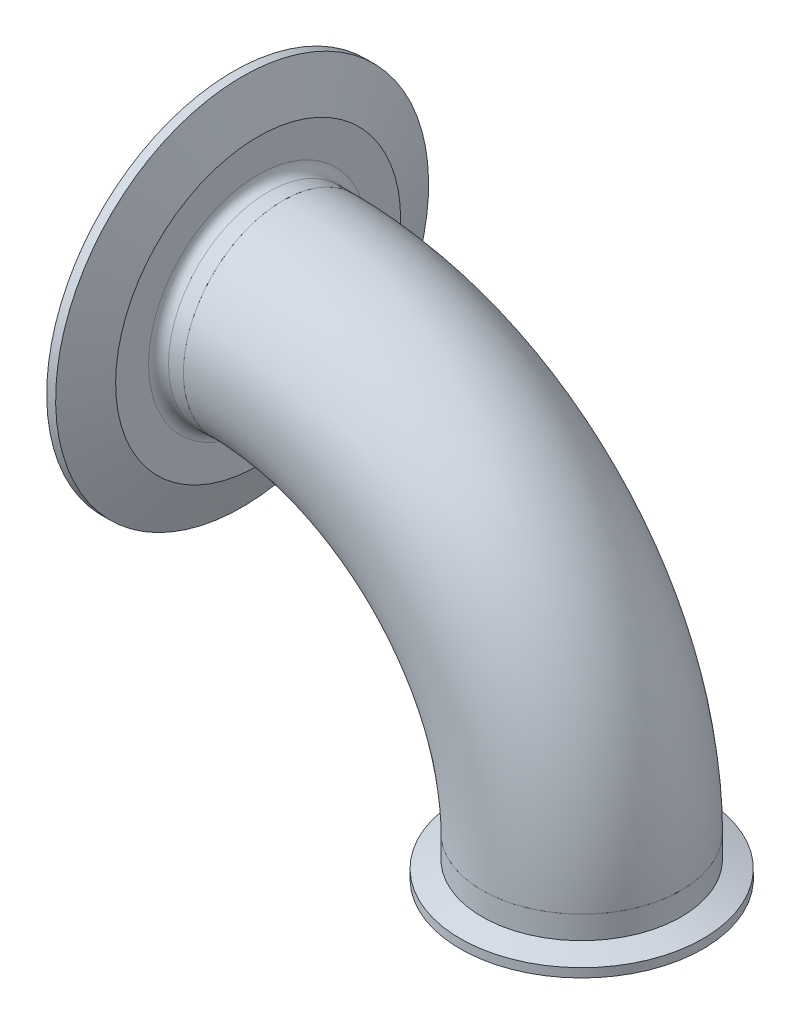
ISO-10303-21;
HEADER;
FILE_DESCRIPTION(('STEP AP214'),'2;1');
FILE_NAME('part.step','',(''),(''),'','','');
FILE_SCHEMA(('AUTOMOTIVE_DESIGN { 1 0 10303 214 1 1 1 1 }'));
ENDSEC;
DATA;
#1=APPLICATION_CONTEXT('core data for automotive mechanical design processes');
#2=APPLICATION_PROTOCOL_DEFINITION('international standard','automotive_design',2000,#1);
#3=PRODUCT_CONTEXT('',#1,'mechanical');
#4=PRODUCT('Part','Part','',(#3));
#5=PRODUCT_RELATED_PRODUCT_CATEGORY('part','',(#4));
#6=PRODUCT_DEFINITION_FORMATION('','',#4);
#7=PRODUCT_DEFINITION_CONTEXT('part definition',#1,'design');
#8=PRODUCT_DEFINITION('design','',#6,#7);
#9=PRODUCT_DEFINITION_SHAPE('','',#8);
#10=(LENGTH_UNIT() NAMED_UNIT(*) SI_UNIT(.MILLI.,.METRE.));
#11=(NAMED_UNIT(*) PLANE_ANGLE_UNIT() SI_UNIT($,.RADIAN.));
#12=(NAMED_UNIT(*) SI_UNIT($,.STERADIAN.) SOLID_ANGLE_UNIT());
#13=UNCERTAINTY_MEASURE_WITH_UNIT(LENGTH_MEASURE(1.E-05),#10,'distance_accuracy_value','');
#14=(GEOMETRIC_REPRESENTATION_CONTEXT(3) GLOBAL_UNCERTAINTY_ASSIGNED_CONTEXT((#13)) GLOBAL_UNIT_ASSIGNED_CONTEXT((#10,
#11,#12)) REPRESENTATION_CONTEXT('',''));
#15=CARTESIAN_POINT('',(0.,0.,0.));
#16=DIRECTION('',(0.,0.,1.));
#17=DIRECTION('',(1.,0.,0.));
#18=AXIS2_PLACEMENT_3D('',#15,#16,#17);
#19=CARTESIAN_POINT('',(-0.267699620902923,45.4213983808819,136.807967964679));
#20=DIRECTION('',(0.,0.,-1.));
#21=DIRECTION('',(-1.,0.,0.));
#22=AXIS2_PLACEMENT_3D('',#19,#20,#21);
#23=TOROIDAL_SURFACE('',#22,95.25,31.75);
#24=CARTESIAN_POINT('',(-0.267699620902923,140.671398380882,136.807967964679));
#25=DIRECTION('',(-1.,0.,0.));
#26=DIRECTION('',(0.,0.,1.));
#27=AXIS2_PLACEMENT_3D('',#24,#25,#26);
#28=CIRCLE('',#27,31.75);
#29=CARTESIAN_POINT('',(-0.267699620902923,172.421398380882,136.807967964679));
#30=VERTEX_POINT('',#29);
#31=EDGE_CURVE('P0_E10',#30,#30,#28,.T.);
#32=CARTESIAN_POINT('',(94.9823003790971,45.4213983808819,136.807967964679));
#33=DIRECTION('',(0.,1.,0.));
#34=DIRECTION('',(0.,0.,1.));
#35=AXIS2_PLACEMENT_3D('',#32,#33,#34);
#36=CIRCLE('',#35,31.75);
#37=CARTESIAN_POINT('',(126.732300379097,45.4213983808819,136.807967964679));
#38=VERTEX_POINT('',#37);
#39=EDGE_CURVE('P0_E21',#38,#38,#36,.T.);
#40=CARTESIAN_POINT('',(-0.267699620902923,45.4213983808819,136.807967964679));
#41=DIRECTION('',(0.,0.,-1.));
#42=DIRECTION('',(-1.,0.,0.));
#43=AXIS2_PLACEMENT_3D('',#40,#41,#42);
#44=CIRCLE('',#43,127.);
#45=EDGE_CURVE('',#30,#38,#44,.T.);
#46=ORIENTED_EDGE('',*,*,#31,.F.);
#47=ORIENTED_EDGE('',*,*,#39,.T.);
#48=ORIENTED_EDGE('',*,*,#45,.T.);
#49=ORIENTED_EDGE('',*,*,#45,.F.);
#50=EDGE_LOOP('',(#46,#48,#47,#49));
#51=FACE_BOUND('',#50,.T.);
#52=ADVANCED_FACE('P0_F15',(#51),#23,.T.);
#53=CARTESIAN_POINT('',(-0.267699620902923,140.671398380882,136.807967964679));
#54=DIRECTION('',(-1.,0.,0.));
#55=DIRECTION('',(0.,0.,1.));
#56=AXIS2_PLACEMENT_3D('',#53,#54,#55);
#57=PLANE('',#56);
#58=CARTESIAN_POINT('',(-0.267699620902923,140.671398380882,136.807967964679));
#59=DIRECTION('',(-1.,0.,0.));
#60=DIRECTION('',(0.,-1.,0.));
#61=AXIS2_PLACEMENT_3D('',#58,#59,#60);
#62=CIRCLE('',#61,30.099);
#63=CARTESIAN_POINT('',(-0.267699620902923,170.770398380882,136.807967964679));
#64=VERTEX_POINT('',#63);
#65=EDGE_CURVE('P0_E25',#64,#64,#62,.T.);
#66=ORIENTED_EDGE('',*,*,#65,.F.);
#67=EDGE_LOOP('',(#66));
#68=FACE_BOUND('',#67,.T.);
#69=ORIENTED_EDGE('',*,*,#31,.T.);
#70=EDGE_LOOP('',(#69));
#71=FACE_BOUND('',#70,.T.);
#72=ADVANCED_FACE('P0_F46',(#68,#71),#57,.T.);
#73=CARTESIAN_POINT('',(94.9823003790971,45.4213983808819,136.807967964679));
#74=DIRECTION('',(0.,1.,0.));
#75=DIRECTION('',(0.,0.,1.));
#76=AXIS2_PLACEMENT_3D('',#73,#74,#75);
#77=PLANE('',#76);
#78=CARTESIAN_POINT('',(94.9823003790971,45.4213983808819,136.807967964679));
#79=DIRECTION('',(0.,1.,0.));
#80=DIRECTION('',(0.,0.,1.));
#81=AXIS2_PLACEMENT_3D('',#78,#79,#80);
#82=CIRCLE('',#81,30.099);
#83=CARTESIAN_POINT('',(125.081300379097,45.4213983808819,136.807967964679));
#84=VERTEX_POINT('',#83);
#85=EDGE_CURVE('P0_E29',#84,#84,#82,.T.);
#86=ORIENTED_EDGE('',*,*,#85,.T.);
#87=EDGE_LOOP('',(#86));
#88=FACE_BOUND('',#87,.T.);
#89=ORIENTED_EDGE('',*,*,#39,.F.);
#90=EDGE_LOOP('',(#89));
#91=FACE_BOUND('',#90,.T.);
#92=ADVANCED_FACE('P0_F35',(#88,#91),#77,.F.);
#93=CARTESIAN_POINT('',(-0.267699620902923,45.4213983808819,136.807967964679));
#94=DIRECTION('',(0.,0.,-1.));
#95=DIRECTION('',(-1.,0.,0.));
#96=AXIS2_PLACEMENT_3D('',#93,#94,#95);
#97=TOROIDAL_SURFACE('',#96,95.25,30.099);
#98=CARTESIAN_POINT('',(-0.267699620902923,45.4213983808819,136.807967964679));
#99=DIRECTION('',(0.,0.,-1.));
#100=DIRECTION('',(-1.,0.,0.));
#101=AXIS2_PLACEMENT_3D('',#98,#99,#100);
#102=CIRCLE('',#101,125.349);
#103=EDGE_CURVE('',#64,#84,#102,.T.);
#104=ORIENTED_EDGE('',*,*,#65,.T.);
#105=ORIENTED_EDGE('',*,*,#85,.F.);
#106=ORIENTED_EDGE('',*,*,#103,.T.);
#107=ORIENTED_EDGE('',*,*,#103,.F.);
#108=EDGE_LOOP('',(#104,#106,#105,#107));
#109=FACE_BOUND('',#108,.T.);
#110=ADVANCED_FACE('P0_F38',(#109),#97,.F.);
#111=CLOSED_SHELL('',(#52,#72,#92,#110));
#112=MANIFOLD_SOLID_BREP('P0_B1',#111);
#113=CARTESIAN_POINT('',(-0.267699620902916,160.541922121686,159.415756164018));
#114=DIRECTION('',(-1.,0.,0.));
#115=DIRECTION('',(0.,0.751114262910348,-0.660172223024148));
#116=AXIS2_PLACEMENT_3D('',#113,#114,#115);
#117=PLANE('',#116);
#118=CARTESIAN_POINT('',(-0.267699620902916,140.671398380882,136.807967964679));
#119=DIRECTION('',(-1.,0.,0.));
#120=DIRECTION('',(0.,0.751114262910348,-0.660172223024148));
#121=AXIS2_PLACEMENT_3D('',#118,#119,#120);
#122=CIRCLE('',#121,31.75);
#123=CARTESIAN_POINT('',(-0.267699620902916,164.519276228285,115.847499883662));
#124=VERTEX_POINT('',#123);
#125=EDGE_CURVE('P1_E9',#124,#124,#122,.T.);
#126=ORIENTED_EDGE('',*,*,#125,.F.);
#127=EDGE_LOOP('',(#126));
#128=FACE_BOUND('',#127,.T.);
#129=CARTESIAN_POINT('',(-0.267699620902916,140.671398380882,136.807967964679));
#130=DIRECTION('',(-1.,0.,0.));
#131=DIRECTION('',(0.,0.751114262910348,-0.660172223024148));
#132=AXIS2_PLACEMENT_3D('',#129,#130,#131);
#133=CIRCLE('',#132,30.099);
#134=CARTESIAN_POINT('',(-0.267699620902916,163.27918658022,116.937444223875));
#135=VERTEX_POINT('',#134);
#136=EDGE_CURVE('P1_E63',#135,#135,#133,.T.);
#137=ORIENTED_EDGE('',*,*,#136,.T.);
#138=EDGE_LOOP('',(#137));
#139=FACE_BOUND('',#138,.T.);
#140=ADVANCED_FACE('P1_F14',(#128,#139),#117,.F.);
#141=CARTESIAN_POINT('',(-16.1426996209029,140.671398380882,136.807967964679));
#142=DIRECTION('',(-1.,0.,0.));
#143=DIRECTION('',(0.,0.751114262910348,-0.660172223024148));
#144=AXIS2_PLACEMENT_3D('',#141,#142,#143);
#145=CYLINDRICAL_SURFACE('',#144,31.75);
#146=CARTESIAN_POINT('',(-5.01749962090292,140.671398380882,136.807967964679));
#147=DIRECTION('',(-1.,0.,0.));
#148=DIRECTION('',(0.,0.751114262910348,-0.660172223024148));
#149=AXIS2_PLACEMENT_3D('',#146,#147,#148);
#150=CIRCLE('',#149,31.75);
#151=CARTESIAN_POINT('',(-5.01749962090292,164.519276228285,115.847499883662));
#152=VERTEX_POINT('',#151);
#153=EDGE_CURVE('P1_E20',#152,#152,#150,.T.);
#154=ORIENTED_EDGE('',*,*,#153,.F.);
#155=EDGE_LOOP('',(#154));
#156=FACE_BOUND('',#155,.T.);
#157=ORIENTED_EDGE('',*,*,#125,.T.);
#158=EDGE_LOOP('',(#157));
#159=FACE_BOUND('',#158,.T.);
#160=ADVANCED_FACE('P1_F142',(#156,#159),#145,.T.);
#161=CARTESIAN_POINT('',(-5.01749962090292,140.671398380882,136.807967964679));
#162=DIRECTION('',(-1.,0.,0.));
#163=DIRECTION('',(0.,0.751114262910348,-0.660172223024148));
#164=AXIS2_PLACEMENT_3D('',#161,#162,#163);
#165=TOROIDAL_SURFACE('',#164,34.925,3.175);
#166=CARTESIAN_POINT('',(-8.19249962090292,140.671398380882,136.807967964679));
#167=DIRECTION('',(-1.,0.,0.));
#168=DIRECTION('',(0.,0.751114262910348,-0.660172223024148));
#169=AXIS2_PLACEMENT_3D('',#166,#167,#168);
#170=CIRCLE('',#169,34.925);
#171=CARTESIAN_POINT('',(-8.19249962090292,166.904064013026,113.751453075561));
#172=VERTEX_POINT('',#171);
#173=EDGE_CURVE('P1_E24',#172,#172,#170,.T.);
#174=ORIENTED_EDGE('',*,*,#173,.F.);
#175=EDGE_LOOP('',(#174));
#176=FACE_BOUND('',#175,.T.);
#177=ORIENTED_EDGE('',*,*,#153,.T.);
#178=EDGE_LOOP('',(#177));
#179=FACE_BOUND('',#178,.T.);
#180=ADVANCED_FACE('P1_F137',(#176,#179),#165,.F.);
#181=CARTESIAN_POINT('',(-8.19249962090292,163.72791327,163.040633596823));
#182=DIRECTION('',(-1.,0.,0.));
#183=DIRECTION('',(0.,0.751114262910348,-0.660172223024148));
#184=AXIS2_PLACEMENT_3D('',#181,#182,#183);
#185=PLANE('',#184);
#186=CARTESIAN_POINT('',(-8.19249962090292,140.671398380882,136.807967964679));
#187=DIRECTION('',(-1.,0.,0.));
#188=DIRECTION('',(0.,0.751114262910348,-0.660172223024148));
#189=AXIS2_PLACEMENT_3D('',#186,#187,#188);
#190=CIRCLE('',#189,45.4344287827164);
#191=CARTESIAN_POINT('',(-8.19249962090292,174.797845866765,106.813420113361));
#192=VERTEX_POINT('',#191);
#193=EDGE_CURVE('P1_E28',#192,#192,#190,.T.);
#194=ORIENTED_EDGE('',*,*,#193,.F.);
#195=EDGE_LOOP('',(#194));
#196=FACE_BOUND('',#195,.T.);
#197=ORIENTED_EDGE('',*,*,#173,.T.);
#198=EDGE_LOOP('',(#197));
#199=FACE_BOUND('',#198,.T.);
#200=ADVANCED_FACE('P1_F131',(#196,#199),#185,.F.);
#201=CARTESIAN_POINT('',(-8.19249962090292,140.671398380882,136.807967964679));
#202=DIRECTION('',(-1.,0.,0.));
#203=DIRECTION('',(0.,0.751114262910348,-0.660172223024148));
#204=AXIS2_PLACEMENT_3D('',#201,#202,#203);
#205=CONICAL_SURFACE('',#204,45.4344287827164,1.22173047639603);
#206=CARTESIAN_POINT('',(-13.2978996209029,140.671398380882,136.807967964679));
#207=DIRECTION('',(-1.,0.,0.));
#208=DIRECTION('',(0.,0.751114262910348,-0.660172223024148));
#209=AXIS2_PLACEMENT_3D('',#206,#207,#208);
#210=CIRCLE('',#209,59.4614);
#211=CARTESIAN_POINT('',(-13.2978996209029,185.333704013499,97.5532033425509));
#212=VERTEX_POINT('',#211);
#213=EDGE_CURVE('P1_E33',#212,#212,#210,.T.);
#214=ORIENTED_EDGE('',*,*,#213,.F.);
#215=EDGE_LOOP('',(#214));
#216=FACE_BOUND('',#215,.T.);
#217=ORIENTED_EDGE('',*,*,#193,.T.);
#218=EDGE_LOOP('',(#217));
#219=FACE_BOUND('',#218,.T.);
#220=ADVANCED_FACE('P1_F125',(#216,#219),#205,.T.);
#221=CARTESIAN_POINT('',(-16.1426996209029,140.671398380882,136.807967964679));
#222=DIRECTION('',(-1.,0.,0.));
#223=DIRECTION('',(0.,0.751114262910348,-0.660172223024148));
#224=AXIS2_PLACEMENT_3D('',#221,#222,#223);
#225=CYLINDRICAL_SURFACE('',#224,59.4614);
#226=CARTESIAN_POINT('',(-16.1426996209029,140.671398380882,136.807967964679));
#227=DIRECTION('',(-1.,0.,0.));
#228=DIRECTION('',(0.,0.751114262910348,-0.660172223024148));
#229=AXIS2_PLACEMENT_3D('',#226,#227,#228);
#230=CIRCLE('',#229,59.4614);
#231=CARTESIAN_POINT('',(-16.1426996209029,185.333704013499,97.5532033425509));
#232=VERTEX_POINT('',#231);
#233=EDGE_CURVE('P1_E36',#232,#232,#230,.T.);
#234=ORIENTED_EDGE('',*,*,#233,.F.);
#235=EDGE_LOOP('',(#234));
#236=FACE_BOUND('',#235,.T.);
#237=ORIENTED_EDGE('',*,*,#213,.T.);
#238=EDGE_LOOP('',(#237));
#239=FACE_BOUND('',#238,.T.);
#240=ADVANCED_FACE('P1_F119',(#236,#239),#225,.T.);
#241=CARTESIAN_POINT('',(-16.1426996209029,179.92616300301,181.470273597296));
#242=DIRECTION('',(1.,0.,0.));
#243=DIRECTION('',(0.,-0.751114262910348,0.660172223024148));
#244=AXIS2_PLACEMENT_3D('',#241,#242,#243);
#245=PLANE('',#244);
#246=CARTESIAN_POINT('',(-16.1426996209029,140.671398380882,136.807967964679));
#247=DIRECTION('',(-1.,0.,0.));
#248=DIRECTION('',(0.,0.751114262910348,-0.660172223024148));
#249=AXIS2_PLACEMENT_3D('',#246,#247,#248);
#250=CIRCLE('',#249,56.924857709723);
#251=CARTESIAN_POINT('',(-16.1426996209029,183.428470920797,99.2277581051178));
#252=VERTEX_POINT('',#251);
#253=EDGE_CURVE('P1_E39',#252,#252,#250,.T.);
#254=ORIENTED_EDGE('',*,*,#253,.F.);
#255=EDGE_LOOP('',(#254));
#256=FACE_BOUND('',#255,.T.);
#257=ORIENTED_EDGE('',*,*,#233,.T.);
#258=EDGE_LOOP('',(#257));
#259=FACE_BOUND('',#258,.T.);
#260=ADVANCED_FACE('P1_F113',(#256,#259),#245,.F.);
#261=CARTESIAN_POINT('',(-15.365980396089,140.671398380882,136.807967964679));
#262=DIRECTION('',(-1.,0.,0.));
#263=DIRECTION('',(0.,0.751114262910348,-0.660172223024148));
#264=AXIS2_PLACEMENT_3D('',#261,#262,#263);
#265=TOROIDAL_SURFACE('',#264,56.7956059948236,0.787400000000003);
#266=CARTESIAN_POINT('',(-15.6736420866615,140.671398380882,136.807967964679));
#267=DIRECTION('',(-1.,0.,0.));
#268=DIRECTION('',(0.,0.751114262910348,-0.660172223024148));
#269=AXIS2_PLACEMENT_3D('',#266,#267,#268);
#270=CIRCLE('',#269,56.0708004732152);
#271=CARTESIAN_POINT('',(-15.6736420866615,182.786976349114,99.7915829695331));
#272=VERTEX_POINT('',#271);
#273=EDGE_CURVE('P1_E42',#272,#272,#270,.T.);
#274=ORIENTED_EDGE('',*,*,#273,.F.);
#275=EDGE_LOOP('',(#274));
#276=FACE_BOUND('',#275,.T.);
#277=ORIENTED_EDGE('',*,*,#253,.T.);
#278=EDGE_LOOP('',(#277));
#279=FACE_BOUND('',#278,.T.);
#280=ADVANCED_FACE('P1_F107',(#276,#279),#265,.T.);
#281=CARTESIAN_POINT('',(-15.6736420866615,140.671398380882,136.807967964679));
#282=DIRECTION('',(-1.,0.,0.));
#283=DIRECTION('',(0.,0.751114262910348,-0.660172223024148));
#284=AXIS2_PLACEMENT_3D('',#281,#282,#283);
#285=CONICAL_SURFACE('',#284,56.0708004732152,0.401425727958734);
#286=CARTESIAN_POINT('',(-15.2698447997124,140.671398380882,136.807967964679));
#287=DIRECTION('',(-1.,0.,0.));
#288=DIRECTION('',(0.,0.751114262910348,-0.660172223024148));
#289=AXIS2_PLACEMENT_3D('',#286,#287,#288);
#290=CIRCLE('',#289,55.8993986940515);
#291=CARTESIAN_POINT('',(-15.2698447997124,182.658234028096,99.9047376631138));
#292=VERTEX_POINT('',#291);
#293=EDGE_CURVE('P1_E45',#292,#292,#290,.T.);
#294=ORIENTED_EDGE('',*,*,#293,.F.);
#295=EDGE_LOOP('',(#294));
#296=FACE_BOUND('',#295,.T.);
#297=ORIENTED_EDGE('',*,*,#273,.T.);
#298=EDGE_LOOP('',(#297));
#299=FACE_BOUND('',#298,.T.);
#300=ADVANCED_FACE('P1_F101',(#296,#299),#285,.F.);
#301=CARTESIAN_POINT('',(-15.7362996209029,140.671398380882,136.807967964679));
#302=DIRECTION('',(-1.,0.,0.));
#303=DIRECTION('',(0.,0.751114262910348,-0.660172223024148));
#304=AXIS2_PLACEMENT_3D('',#301,#302,#303);
#305=TOROIDAL_SURFACE('',#304,54.8005,1.1938);
#306=CARTESIAN_POINT('',(-15.2698447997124,140.671398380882,136.807967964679));
#307=DIRECTION('',(-1.,0.,0.));
#308=DIRECTION('',(0.,0.751114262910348,-0.660172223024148));
#309=AXIS2_PLACEMENT_3D('',#306,#307,#308);
#310=CIRCLE('',#309,53.7016013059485);
#311=CARTESIAN_POINT('',(-15.2698447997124,181.007437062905,101.355662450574));
#312=VERTEX_POINT('',#311);
#313=EDGE_CURVE('P1_E48',#312,#312,#310,.T.);
#314=ORIENTED_EDGE('',*,*,#313,.F.);
#315=EDGE_LOOP('',(#314));
#316=FACE_BOUND('',#315,.T.);
#317=ORIENTED_EDGE('',*,*,#293,.T.);
#318=EDGE_LOOP('',(#317));
#319=FACE_BOUND('',#318,.T.);
#320=ADVANCED_FACE('P1_F95',(#316,#319),#305,.F.);
#321=CARTESIAN_POINT('',(-15.2698447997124,140.671398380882,136.807967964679));
#322=DIRECTION('',(1.,0.,0.));
#323=DIRECTION('',(0.,-0.751114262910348,0.660172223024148));
#324=AXIS2_PLACEMENT_3D('',#321,#322,#323);
#325=CONICAL_SURFACE('',#324,53.7016013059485,0.401425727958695);
#326=CARTESIAN_POINT('',(-15.6629613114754,140.671398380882,136.807967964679));
#327=DIRECTION('',(-1.,0.,0.));
#328=DIRECTION('',(0.,0.751114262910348,-0.660172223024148));
#329=AXIS2_PLACEMENT_3D('',#326,#327,#328);
#330=CIRCLE('',#329,53.5347332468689);
#331=CARTESIAN_POINT('',(-15.6629613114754,180.882100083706,101.465824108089));
#332=VERTEX_POINT('',#331);
#333=EDGE_CURVE('P1_E51',#332,#332,#330,.T.);
#334=ORIENTED_EDGE('',*,*,#333,.F.);
#335=EDGE_LOOP('',(#334));
#336=FACE_BOUND('',#335,.T.);
#337=ORIENTED_EDGE('',*,*,#313,.T.);
#338=EDGE_LOOP('',(#337));
#339=FACE_BOUND('',#338,.T.);
#340=ADVANCED_FACE('P1_F89',(#336,#339),#325,.T.);
#341=CARTESIAN_POINT('',(-15.3552996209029,140.671398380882,136.807967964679));
#342=DIRECTION('',(-1.,0.,0.));
#343=DIRECTION('',(0.,0.751114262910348,-0.660172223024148));
#344=AXIS2_PLACEMENT_3D('',#341,#342,#343);
#345=TOROIDAL_SURFACE('',#344,52.8099277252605,0.787399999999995);
#346=CARTESIAN_POINT('',(-16.1426996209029,140.671398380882,136.807967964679));
#347=DIRECTION('',(-1.,0.,0.));
#348=DIRECTION('',(0.,0.751114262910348,-0.660172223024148));
#349=AXIS2_PLACEMENT_3D('',#346,#347,#348);
#350=CIRCLE('',#349,52.8099277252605);
#351=CARTESIAN_POINT('',(-16.1426996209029,180.33768831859,101.944320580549));
#352=VERTEX_POINT('',#351);
#353=EDGE_CURVE('P1_E54',#352,#352,#350,.T.);
#354=ORIENTED_EDGE('',*,*,#353,.F.);
#355=EDGE_LOOP('',(#354));
#356=FACE_BOUND('',#355,.T.);
#357=ORIENTED_EDGE('',*,*,#333,.T.);
#358=EDGE_LOOP('',(#357));
#359=FACE_BOUND('',#358,.T.);
#360=ADVANCED_FACE('P1_F83',(#356,#359),#345,.T.);
#361=CARTESIAN_POINT('',(-16.1426996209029,172.816372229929,173.381073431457));
#362=DIRECTION('',(1.,0.,0.));
#363=DIRECTION('',(0.,-0.751114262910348,0.660172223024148));
#364=AXIS2_PLACEMENT_3D('',#361,#362,#363);
#365=PLANE('',#364);
#366=CARTESIAN_POINT('',(-16.1426996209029,140.671398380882,136.807967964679));
#367=DIRECTION('',(-1.,0.,0.));
#368=DIRECTION('',(0.,0.751114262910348,-0.660172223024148));
#369=AXIS2_PLACEMENT_3D('',#366,#367,#368);
#370=CIRCLE('',#369,48.6918);
#371=CARTESIAN_POINT('',(-16.1426996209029,177.24450384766,104.662994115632));
#372=VERTEX_POINT('',#371);
#373=EDGE_CURVE('P1_E57',#372,#372,#370,.T.);
#374=ORIENTED_EDGE('',*,*,#373,.F.);
#375=EDGE_LOOP('',(#374));
#376=FACE_BOUND('',#375,.T.);
#377=ORIENTED_EDGE('',*,*,#353,.T.);
#378=EDGE_LOOP('',(#377));
#379=FACE_BOUND('',#378,.T.);
#380=ADVANCED_FACE('P1_F77',(#376,#379),#365,.F.);
#381=CARTESIAN_POINT('',(-16.1426996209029,140.671398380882,136.807967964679));
#382=DIRECTION('',(-1.,0.,0.));
#383=DIRECTION('',(0.,0.751114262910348,-0.660172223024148));
#384=AXIS2_PLACEMENT_3D('',#381,#382,#383);
#385=CONICAL_SURFACE('',#384,48.6918,1.16797433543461);
#386=CARTESIAN_POINT('',(-8.21986809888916,140.671398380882,136.807967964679));
#387=DIRECTION('',(-1.,0.,0.));
#388=DIRECTION('',(0.,0.751114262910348,-0.660172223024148));
#389=AXIS2_PLACEMENT_3D('',#386,#387,#388);
#390=CIRCLE('',#389,30.099);
#391=CARTESIAN_POINT('',(-8.21986809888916,163.27918658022,116.937444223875));
#392=VERTEX_POINT('',#391);
#393=EDGE_CURVE('P1_E60',#392,#392,#390,.T.);
#394=ORIENTED_EDGE('',*,*,#393,.F.);
#395=EDGE_LOOP('',(#394));
#396=FACE_BOUND('',#395,.T.);
#397=ORIENTED_EDGE('',*,*,#373,.T.);
#398=EDGE_LOOP('',(#397));
#399=FACE_BOUND('',#398,.T.);
#400=ADVANCED_FACE('P1_F71',(#396,#399),#385,.F.);
#401=CARTESIAN_POINT('',(-16.1426996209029,140.671398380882,136.807967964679));
#402=DIRECTION('',(-1.,0.,0.));
#403=DIRECTION('',(0.,0.751114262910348,-0.660172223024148));
#404=AXIS2_PLACEMENT_3D('',#401,#402,#403);
#405=CYLINDRICAL_SURFACE('',#404,30.099);
#406=ORIENTED_EDGE('',*,*,#136,.F.);
#407=EDGE_LOOP('',(#406));
#408=FACE_BOUND('',#407,.T.);
#409=ORIENTED_EDGE('',*,*,#393,.T.);
#410=EDGE_LOOP('',(#409));
#411=FACE_BOUND('',#410,.T.);
#412=ADVANCED_FACE('P1_F68',(#408,#411),#405,.F.);
#413=CLOSED_SHELL('',(#140,#160,#180,#200,#220,#240,#260,#280,#300,#320,#340,#360,#380,#400,#412));
#414=MANIFOLD_SOLID_BREP('P1_B1',#413);
#415=CARTESIAN_POINT('',(94.982300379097,33.5087983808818,136.807967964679));
#416=DIRECTION('',(0.,-1.00000000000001,0.));
#417=DIRECTION('',(0.,0.,-1.));
#418=AXIS2_PLACEMENT_3D('',#415,#416,#417);
#419=TOROIDAL_SURFACE('',#418,37.1367084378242,0.787400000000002);
#420=CARTESIAN_POINT('',(94.9823003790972,32.7213983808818,136.807967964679));
#421=DIRECTION('',(0.,-1.00000000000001,0.));
#422=DIRECTION('',(0.,0.,-1.));
#423=AXIS2_PLACEMENT_3D('',#420,#421,#422);
#424=CIRCLE('',#423,37.1367084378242);
#425=CARTESIAN_POINT('',(94.9823003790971,32.7213983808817,99.6712595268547));
#426=VERTEX_POINT('',#425);
#427=EDGE_CURVE('P2_E49',#426,#426,#424,.T.);
#428=ORIENTED_EDGE('',*,*,#427,.T.);
#429=EDGE_LOOP('',(#428));
#430=FACE_BOUND('',#429,.T.);
#431=CARTESIAN_POINT('',(94.9823003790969,33.1958573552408,136.807967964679));
#432=DIRECTION('',(0.,-1.00000000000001,0.));
#433=DIRECTION('',(0.,0.,-1.));
#434=AXIS2_PLACEMENT_3D('',#431,#432,#433);
#435=CIRCLE('',#434,36.4141666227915);
#436=CARTESIAN_POINT('',(94.9823003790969,33.1958573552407,100.393801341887));
#437=VERTEX_POINT('',#436);
#438=EDGE_CURVE('P2_E10',#437,#437,#435,.T.);
#439=ORIENTED_EDGE('',*,*,#438,.F.);
#440=EDGE_LOOP('',(#439));
#441=FACE_BOUND('',#440,.T.);
#442=ADVANCED_FACE('P2_F15',(#430,#441),#419,.T.);
#443=CARTESIAN_POINT('',(94.9823003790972,32.7213983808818,136.807967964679));
#444=DIRECTION('',(0.,-1.00000000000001,0.));
#445=DIRECTION('',(0.,0.,-1.));
#446=AXIS2_PLACEMENT_3D('',#443,#444,#445);
#447=TOROIDAL_SURFACE('',#446,35.3187,1.1938);
#448=CARTESIAN_POINT('',(94.9823003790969,33.1958573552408,136.807967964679));
#449=DIRECTION('',(0.,-1.00000000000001,0.));
#450=DIRECTION('',(0.,0.,-1.));
#451=AXIS2_PLACEMENT_3D('',#448,#449,#450);
#452=CIRCLE('',#451,34.2232333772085);
#453=CARTESIAN_POINT('',(94.9823003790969,33.1958573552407,102.58473458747));
#454=VERTEX_POINT('',#453);
#455=EDGE_CURVE('P2_E21',#454,#454,#452,.T.);
#456=ORIENTED_EDGE('',*,*,#455,.F.);
#457=EDGE_LOOP('',(#456));
#458=FACE_BOUND('',#457,.T.);
#459=ORIENTED_EDGE('',*,*,#438,.T.);
#460=EDGE_LOOP('',(#459));
#461=FACE_BOUND('',#460,.T.);
#462=ADVANCED_FACE('P2_F98',(#458,#461),#447,.F.);
#463=CARTESIAN_POINT('',(94.982300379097,33.5087983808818,136.807967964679));
#464=DIRECTION('',(0.,-1.00000000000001,0.));
#465=DIRECTION('',(0.,0.,-1.));
#466=AXIS2_PLACEMENT_3D('',#463,#464,#465);
#467=TOROIDAL_SURFACE('',#466,33.5006915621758,0.787399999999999);
#468=ORIENTED_EDGE('',*,*,#455,.T.);
#469=EDGE_LOOP('',(#468));
#470=FACE_BOUND('',#469,.T.);
#471=CARTESIAN_POINT('',(94.9823003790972,32.7213983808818,136.807967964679));
#472=DIRECTION('',(0.,-1.00000000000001,0.));
#473=DIRECTION('',(0.,0.,-1.));
#474=AXIS2_PLACEMENT_3D('',#471,#472,#473);
#475=CIRCLE('',#474,33.5006915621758);
#476=CARTESIAN_POINT('',(94.9823003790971,32.7213983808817,103.307276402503));
#477=VERTEX_POINT('',#476);
#478=EDGE_CURVE('P2_E25',#477,#477,#475,.T.);
#479=ORIENTED_EDGE('',*,*,#478,.F.);
#480=EDGE_LOOP('',(#479));
#481=FACE_BOUND('',#480,.T.);
#482=ADVANCED_FACE('P2_F94',(#470,#481),#467,.T.);
#483=CARTESIAN_POINT('',(94.9823003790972,32.7213983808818,136.807967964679));
#484=DIRECTION('',(0.,1.00000000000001,0.));
#485=DIRECTION('',(0.,0.,1.));
#486=AXIS2_PLACEMENT_3D('',#483,#484,#485);
#487=PLANE('',#486);
#488=CARTESIAN_POINT('',(94.9823003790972,32.7213983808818,136.807967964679));
#489=DIRECTION('',(0.,-1.00000000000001,0.));
#490=DIRECTION('',(0.,0.,-1.));
#491=AXIS2_PLACEMENT_3D('',#488,#489,#490);
#492=CIRCLE('',#491,30.099);
#493=CARTESIAN_POINT('',(94.9823003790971,32.7213983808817,106.708967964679));
#494=VERTEX_POINT('',#493);
#495=EDGE_CURVE('P2_E29',#494,#494,#492,.T.);
#496=ORIENTED_EDGE('',*,*,#495,.F.);
#497=EDGE_LOOP('',(#496));
#498=FACE_BOUND('',#497,.T.);
#499=ORIENTED_EDGE('',*,*,#478,.T.);
#500=EDGE_LOOP('',(#499));
#501=FACE_BOUND('',#500,.T.);
#502=ADVANCED_FACE('P2_F87',(#498,#501),#487,.F.);
#503=CARTESIAN_POINT('',(94.9823003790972,32.7213983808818,136.807967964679));
#504=DIRECTION('',(0.,-1.00000000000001,0.));
#505=DIRECTION('',(0.,0.,-1.));
#506=AXIS2_PLACEMENT_3D('',#503,#504,#505);
#507=CYLINDRICAL_SURFACE('',#506,30.099);
#508=ORIENTED_EDGE('',*,*,#495,.T.);
#509=EDGE_LOOP('',(#508));
#510=FACE_BOUND('',#509,.T.);
#511=CARTESIAN_POINT('',(94.9823003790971,45.4213983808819,136.807967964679));
#512=DIRECTION('',(0.,-1.00000000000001,0.));
#513=DIRECTION('',(0.,0.,-1.));
#514=AXIS2_PLACEMENT_3D('',#511,#512,#513);
#515=CIRCLE('',#514,30.099);
#516=CARTESIAN_POINT('',(94.9823003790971,45.4213983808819,106.708967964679));
#517=VERTEX_POINT('',#516);
#518=EDGE_CURVE('P2_E34',#517,#517,#515,.T.);
#519=ORIENTED_EDGE('',*,*,#518,.F.);
#520=EDGE_LOOP('',(#519));
#521=FACE_BOUND('',#520,.T.);
#522=ADVANCED_FACE('P2_F82',(#510,#521),#507,.F.);
#523=CARTESIAN_POINT('',(94.9823003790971,45.4213983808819,136.807967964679));
#524=DIRECTION('',(0.,-1.00000000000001,0.));
#525=DIRECTION('',(0.,0.,-1.));
#526=AXIS2_PLACEMENT_3D('',#523,#524,#525);
#527=PLANE('',#526);
#528=CARTESIAN_POINT('',(94.9823003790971,45.4213983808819,136.807967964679));
#529=DIRECTION('',(0.,-1.00000000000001,0.));
#530=DIRECTION('',(0.,0.,-1.));
#531=AXIS2_PLACEMENT_3D('',#528,#529,#530);
#532=CIRCLE('',#531,31.75);
#533=CARTESIAN_POINT('',(94.9823003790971,45.4213983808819,105.057967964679));
#534=VERTEX_POINT('',#533);
#535=EDGE_CURVE('P2_E37',#534,#534,#532,.T.);
#536=ORIENTED_EDGE('',*,*,#535,.F.);
#537=EDGE_LOOP('',(#536));
#538=FACE_BOUND('',#537,.T.);
#539=ORIENTED_EDGE('',*,*,#518,.T.);
#540=EDGE_LOOP('',(#539));
#541=FACE_BOUND('',#540,.T.);
#542=ADVANCED_FACE('P2_F76',(#538,#541),#527,.F.);
#543=CARTESIAN_POINT('',(94.9823003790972,32.7213983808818,136.807967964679));
#544=DIRECTION('',(0.,-1.00000000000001,0.));
#545=DIRECTION('',(0.,0.,-1.));
#546=AXIS2_PLACEMENT_3D('',#543,#544,#545);
#547=CYLINDRICAL_SURFACE('',#546,31.75);
#548=CARTESIAN_POINT('',(94.9823003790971,38.0992856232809,136.807967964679));
#549=DIRECTION('',(0.,-1.00000000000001,0.));
#550=DIRECTION('',(0.,0.,-1.));
#551=AXIS2_PLACEMENT_3D('',#548,#549,#550);
#552=CIRCLE('',#551,31.75);
#553=CARTESIAN_POINT('',(94.9823003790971,38.0992856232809,105.057967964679));
#554=VERTEX_POINT('',#553);
#555=EDGE_CURVE('P2_E40',#554,#554,#552,.T.);
#556=ORIENTED_EDGE('',*,*,#555,.F.);
#557=EDGE_LOOP('',(#556));
#558=FACE_BOUND('',#557,.T.);
#559=ORIENTED_EDGE('',*,*,#535,.T.);
#560=EDGE_LOOP('',(#559));
#561=FACE_BOUND('',#560,.T.);
#562=ADVANCED_FACE('P2_F70',(#558,#561),#547,.T.);
#563=CARTESIAN_POINT('',(94.9823003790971,38.0992856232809,136.807967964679));
#564=DIRECTION('',(0.,-1.00000000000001,0.));
#565=DIRECTION('',(0.,0.,-1.));
#566=AXIS2_PLACEMENT_3D('',#563,#564,#565);
#567=CONICAL_SURFACE('',#566,31.75,1.22173047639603);
#568=CARTESIAN_POINT('',(94.9823003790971,35.5661983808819,136.807967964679));
#569=DIRECTION('',(0.,-1.00000000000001,0.));
#570=DIRECTION('',(0.,0.,-1.));
#571=AXIS2_PLACEMENT_3D('',#568,#569,#570);
#572=CIRCLE('',#571,38.7096);
#573=CARTESIAN_POINT('',(94.982300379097,35.5661983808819,98.0983679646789));
#574=VERTEX_POINT('',#573);
#575=EDGE_CURVE('P2_E43',#574,#574,#572,.T.);
#576=ORIENTED_EDGE('',*,*,#575,.F.);
#577=EDGE_LOOP('',(#576));
#578=FACE_BOUND('',#577,.T.);
#579=ORIENTED_EDGE('',*,*,#555,.T.);
#580=EDGE_LOOP('',(#579));
#581=FACE_BOUND('',#580,.T.);
#582=ADVANCED_FACE('P2_F64',(#578,#581),#567,.T.);
#583=CARTESIAN_POINT('',(94.9823003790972,32.7213983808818,136.807967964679));
#584=DIRECTION('',(0.,-1.00000000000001,0.));
#585=DIRECTION('',(0.,0.,-1.));
#586=AXIS2_PLACEMENT_3D('',#583,#584,#585);
#587=CYLINDRICAL_SURFACE('',#586,38.7096);
#588=CARTESIAN_POINT('',(94.9823003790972,32.7213983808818,136.807967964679));
#589=DIRECTION('',(0.,-1.00000000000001,0.));
#590=DIRECTION('',(0.,0.,-1.));
#591=AXIS2_PLACEMENT_3D('',#588,#589,#590);
#592=CIRCLE('',#591,38.7096);
#593=CARTESIAN_POINT('',(94.9823003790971,32.7213983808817,98.0983679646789));
#594=VERTEX_POINT('',#593);
#595=EDGE_CURVE('P2_E46',#594,#594,#592,.T.);
#596=ORIENTED_EDGE('',*,*,#595,.F.);
#597=EDGE_LOOP('',(#596));
#598=FACE_BOUND('',#597,.T.);
#599=ORIENTED_EDGE('',*,*,#575,.T.);
#600=EDGE_LOOP('',(#599));
#601=FACE_BOUND('',#600,.T.);
#602=ADVANCED_FACE('P2_F58',(#598,#601),#587,.T.);
#603=CARTESIAN_POINT('',(94.9823003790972,32.7213983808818,136.807967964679));
#604=DIRECTION('',(0.,1.00000000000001,0.));
#605=DIRECTION('',(0.,0.,1.));
#606=AXIS2_PLACEMENT_3D('',#603,#604,#605);
#607=PLANE('',#606);
#608=ORIENTED_EDGE('',*,*,#427,.F.);
#609=EDGE_LOOP('',(#608));
#610=FACE_BOUND('',#609,.T.);
#611=ORIENTED_EDGE('',*,*,#595,.T.);
#612=EDGE_LOOP('',(#611));
#613=FACE_BOUND('',#612,.T.);
#614=ADVANCED_FACE('P2_F55',(#610,#613),#607,.F.);
#615=CLOSED_SHELL('',(#442,#462,#482,#502,#522,#542,#562,#582,#602,#614));
#616=MANIFOLD_SOLID_BREP('P2_B1',#615);
#617=ADVANCED_BREP_SHAPE_REPRESENTATION('',(#18,#112,#414,#616),#14);
#618=SHAPE_DEFINITION_REPRESENTATION(#9,#617);
ENDSEC;
END-ISO-10303-21;
